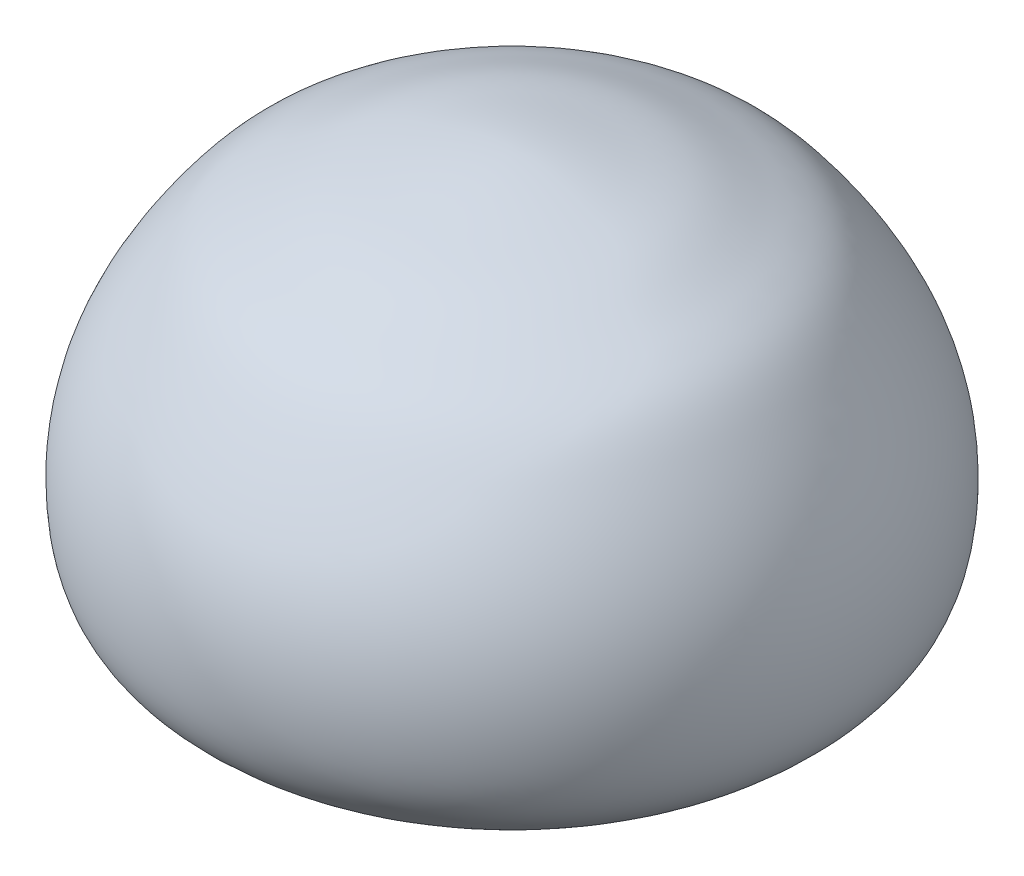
from build123d import *


with BuildPart() as part:
    # Esquisse1 → R_volution1 (revolve)
    with BuildSketch(Plane.XY):
        with BuildLine():
            Line((569.286388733, 369.057921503), (601.214527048, 369.057921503))
            Line((601.214527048, 369.057921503), (601.214527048, 424.085522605))
            add(Edge.make_bspline(
                [(569.286388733, 369.057921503), (565.472641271, 370.249337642), (558.487684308, 374.050311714), (556.311075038, 385.388947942), (557.857667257, 397.343587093), (563.719945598, 407.308253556), (570.130167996, 415.109142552), (576.663631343, 417.907629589), (582.882262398, 420.894051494), (590.988006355, 422.756573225), (597.22374784, 424.062667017), (601.214527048, 424.085522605)],
                knots=[0, 0, 0, 0, 0.075881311, 0.125133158, 0.19892986, 0.290923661, 0.330647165, 0.378894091, 0.416865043, 0.455565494, 0.529347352, 0.529347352, 0.529347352, 0.529347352], degree=3))
        make_face()
    revolve(axis=Axis((601.214527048, 369.057921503, 0), (0, 1, 0)))


solid = part.part
